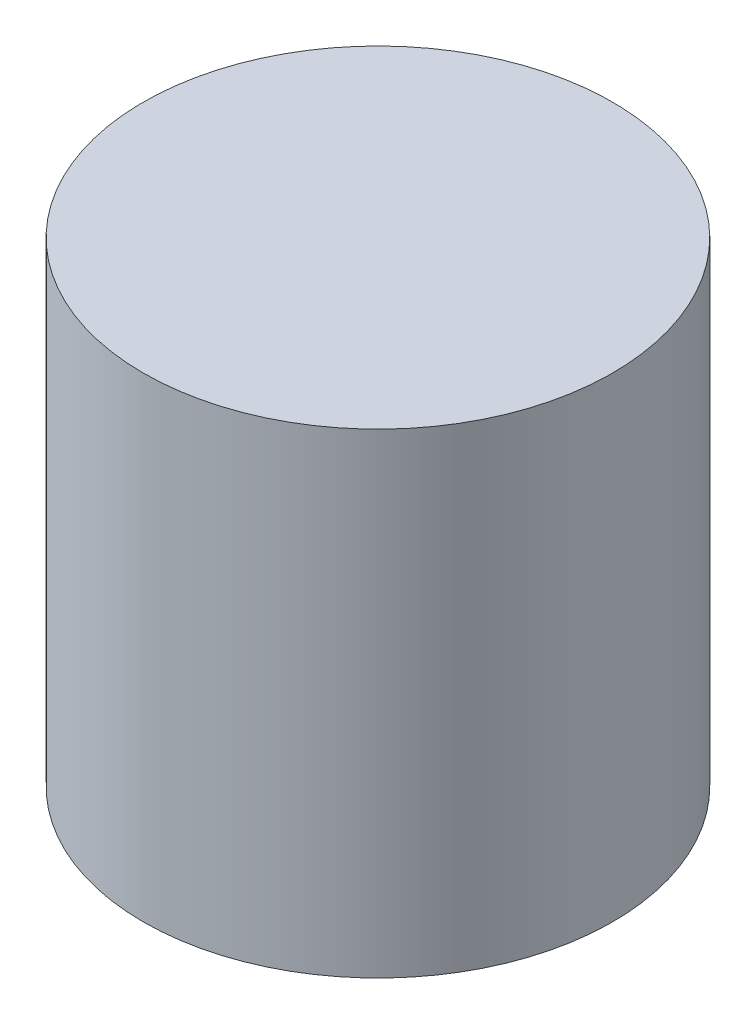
ISO-10303-21;
HEADER;
FILE_DESCRIPTION(('STEP AP214'),'2;1');
FILE_NAME('part.step','',(''),(''),'','','');
FILE_SCHEMA(('AUTOMOTIVE_DESIGN { 1 0 10303 214 1 1 1 1 }'));
ENDSEC;
DATA;
#1=APPLICATION_CONTEXT('core data for automotive mechanical design processes');
#2=APPLICATION_PROTOCOL_DEFINITION('international standard','automotive_design',2000,#1);
#3=PRODUCT_CONTEXT('',#1,'mechanical');
#4=PRODUCT('Part','Part','',(#3));
#5=PRODUCT_RELATED_PRODUCT_CATEGORY('part','',(#4));
#6=PRODUCT_DEFINITION_FORMATION('','',#4);
#7=PRODUCT_DEFINITION_CONTEXT('part definition',#1,'design');
#8=PRODUCT_DEFINITION('design','',#6,#7);
#9=PRODUCT_DEFINITION_SHAPE('','',#8);
#10=(LENGTH_UNIT() NAMED_UNIT(*) SI_UNIT(.MILLI.,.METRE.));
#11=(NAMED_UNIT(*) PLANE_ANGLE_UNIT() SI_UNIT($,.RADIAN.));
#12=(NAMED_UNIT(*) SI_UNIT($,.STERADIAN.) SOLID_ANGLE_UNIT());
#13=UNCERTAINTY_MEASURE_WITH_UNIT(LENGTH_MEASURE(1.E-05),#10,'distance_accuracy_value','');
#14=(GEOMETRIC_REPRESENTATION_CONTEXT(3) GLOBAL_UNCERTAINTY_ASSIGNED_CONTEXT((#13)) GLOBAL_UNIT_ASSIGNED_CONTEXT((#10,
#11,#12)) REPRESENTATION_CONTEXT('',''));
#15=CARTESIAN_POINT('',(0.,0.,0.));
#16=DIRECTION('',(0.,0.,1.));
#17=DIRECTION('',(1.,0.,0.));
#18=AXIS2_PLACEMENT_3D('',#15,#16,#17);
#19=CARTESIAN_POINT('',(0.,78.74,0.));
#20=DIRECTION('',(0.,-1.,0.));
#21=DIRECTION('',(0.,0.,-1.));
#22=AXIS2_PLACEMENT_3D('',#19,#20,#21);
#23=CYLINDRICAL_SURFACE('',#22,38.8672245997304);
#24=CARTESIAN_POINT('',(0.,78.74,0.));
#25=DIRECTION('',(0.,1.,0.));
#26=DIRECTION('',(0.,0.,1.));
#27=AXIS2_PLACEMENT_3D('',#24,#25,#26);
#28=CIRCLE('',#27,38.8672245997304);
#29=CARTESIAN_POINT('',(0.,78.74,38.8672245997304));
#30=VERTEX_POINT('',#29);
#31=EDGE_CURVE('E12',#30,#30,#28,.T.);
#32=ORIENTED_EDGE('',*,*,#31,.F.);
#33=EDGE_LOOP('',(#32));
#34=FACE_BOUND('',#33,.T.);
#35=CARTESIAN_POINT('',(0.,0.,0.));
#36=DIRECTION('',(0.,1.,0.));
#37=DIRECTION('',(0.,0.,1.));
#38=AXIS2_PLACEMENT_3D('',#35,#36,#37);
#39=CIRCLE('',#38,38.8672245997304);
#40=CARTESIAN_POINT('',(0.,0.,38.8672245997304));
#41=VERTEX_POINT('',#40);
#42=EDGE_CURVE('E45',#41,#41,#39,.T.);
#43=ORIENTED_EDGE('',*,*,#42,.T.);
#44=EDGE_LOOP('',(#43));
#45=FACE_BOUND('',#44,.T.);
#46=ADVANCED_FACE('F42',(#34,#45),#23,.T.);
#47=CARTESIAN_POINT('',(0.,78.74,0.));
#48=DIRECTION('',(0.,1.,0.));
#49=DIRECTION('',(0.,0.,1.));
#50=AXIS2_PLACEMENT_3D('',#47,#48,#49);
#51=PLANE('',#50);
#52=ORIENTED_EDGE('',*,*,#31,.T.);
#53=EDGE_LOOP('',(#52));
#54=FACE_BOUND('',#53,.T.);
#55=ADVANCED_FACE('F57',(#54),#51,.T.);
#56=CARTESIAN_POINT('',(0.,0.,0.));
#57=DIRECTION('',(0.,1.,0.));
#58=DIRECTION('',(0.,0.,1.));
#59=AXIS2_PLACEMENT_3D('',#56,#57,#58);
#60=PLANE('',#59);
#61=ORIENTED_EDGE('',*,*,#42,.F.);
#62=EDGE_LOOP('',(#61));
#63=FACE_BOUND('',#62,.T.);
#64=ADVANCED_FACE('F55',(#63),#60,.F.);
#65=CLOSED_SHELL('',(#46,#55,#64));
#66=MANIFOLD_SOLID_BREP('B2',#65);
#67=ADVANCED_BREP_SHAPE_REPRESENTATION('',(#18,#66),#14);
#68=SHAPE_DEFINITION_REPRESENTATION(#9,#67);
ENDSEC;
END-ISO-10303-21;
